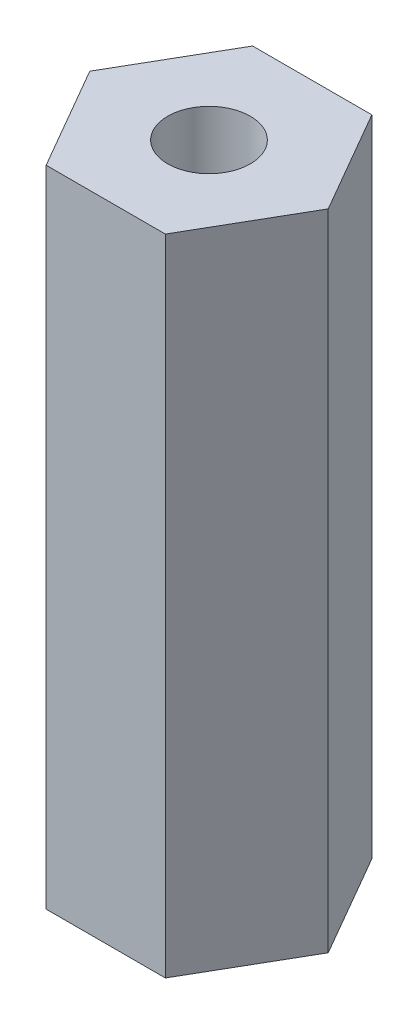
ISO-10303-21;
HEADER;
FILE_DESCRIPTION(('STEP AP214'),'2;1');
FILE_NAME('part.step','',(''),(''),'','','');
FILE_SCHEMA(('AUTOMOTIVE_DESIGN { 1 0 10303 214 1 1 1 1 }'));
ENDSEC;
DATA;
#1=APPLICATION_CONTEXT('core data for automotive mechanical design processes');
#2=APPLICATION_PROTOCOL_DEFINITION('international standard','automotive_design',2000,#1);
#3=PRODUCT_CONTEXT('',#1,'mechanical');
#4=PRODUCT('Part','Part','',(#3));
#5=PRODUCT_RELATED_PRODUCT_CATEGORY('part','',(#4));
#6=PRODUCT_DEFINITION_FORMATION('','',#4);
#7=PRODUCT_DEFINITION_CONTEXT('part definition',#1,'design');
#8=PRODUCT_DEFINITION('design','',#6,#7);
#9=PRODUCT_DEFINITION_SHAPE('','',#8);
#10=(LENGTH_UNIT() NAMED_UNIT(*) SI_UNIT(.MILLI.,.METRE.));
#11=(NAMED_UNIT(*) PLANE_ANGLE_UNIT() SI_UNIT($,.RADIAN.));
#12=(NAMED_UNIT(*) SI_UNIT($,.STERADIAN.) SOLID_ANGLE_UNIT());
#13=UNCERTAINTY_MEASURE_WITH_UNIT(LENGTH_MEASURE(1.E-05),#10,'distance_accuracy_value','');
#14=(GEOMETRIC_REPRESENTATION_CONTEXT(3) GLOBAL_UNCERTAINTY_ASSIGNED_CONTEXT((#13)) GLOBAL_UNIT_ASSIGNED_CONTEXT((#10,
#11,#12)) REPRESENTATION_CONTEXT('',''));
#15=CARTESIAN_POINT('',(0.,0.,0.));
#16=DIRECTION('',(0.,0.,1.));
#17=DIRECTION('',(1.,0.,0.));
#18=AXIS2_PLACEMENT_3D('',#15,#16,#17);
#19=CARTESIAN_POINT('',(0.,19.812,0.));
#20=DIRECTION('',(0.,1.,0.));
#21=DIRECTION('',(0.,0.,1.));
#22=AXIS2_PLACEMENT_3D('',#19,#20,#21);
#23=PLANE('',#22);
#24=DIRECTION('',(0.5,0.,-0.866025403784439));
#25=VECTOR('',#24,1.);
#26=CARTESIAN_POINT('',(1.83308710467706,19.812,3.175));
#27=LINE('',#26,#25);
#28=CARTESIAN_POINT('',(1.83308710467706,19.812,3.175));
#29=VERTEX_POINT('',#28);
#30=CARTESIAN_POINT('',(3.66617420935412,19.812,0.));
#31=VERTEX_POINT('',#30);
#32=EDGE_CURVE('E128',#29,#31,#27,.T.);
#33=ORIENTED_EDGE('',*,*,#32,.T.);
#34=DIRECTION('',(-0.5,0.,-0.866025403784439));
#35=VECTOR('',#34,1.);
#36=CARTESIAN_POINT('',(3.66617420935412,19.812,0.));
#37=LINE('',#36,#35);
#38=CARTESIAN_POINT('',(1.83308710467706,19.812,-3.175));
#39=VERTEX_POINT('',#38);
#40=EDGE_CURVE('E86',#31,#39,#37,.T.);
#41=ORIENTED_EDGE('',*,*,#40,.T.);
#42=DIRECTION('',(-1.,0.,0.));
#43=VECTOR('',#42,1.);
#44=CARTESIAN_POINT('',(1.83308710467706,19.812,-3.175));
#45=LINE('',#44,#43);
#46=CARTESIAN_POINT('',(-1.83308710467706,19.812,-3.175));
#47=VERTEX_POINT('',#46);
#48=EDGE_CURVE('E99',#39,#47,#45,.T.);
#49=ORIENTED_EDGE('',*,*,#48,.T.);
#50=DIRECTION('',(-0.5,0.,0.866025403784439));
#51=VECTOR('',#50,1.);
#52=CARTESIAN_POINT('',(-1.83308710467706,19.812,-3.175));
#53=LINE('',#52,#51);
#54=CARTESIAN_POINT('',(-3.66617420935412,19.812,0.));
#55=VERTEX_POINT('',#54);
#56=EDGE_CURVE('E93',#47,#55,#53,.T.);
#57=ORIENTED_EDGE('',*,*,#56,.T.);
#58=DIRECTION('',(0.5,0.,0.866025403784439));
#59=VECTOR('',#58,1.);
#60=CARTESIAN_POINT('',(-3.66617420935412,19.812,0.));
#61=LINE('',#60,#59);
#62=CARTESIAN_POINT('',(-1.83308710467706,19.812,3.175));
#63=VERTEX_POINT('',#62);
#64=EDGE_CURVE('E97',#55,#63,#61,.T.);
#65=ORIENTED_EDGE('',*,*,#64,.T.);
#66=DIRECTION('',(1.,0.,0.));
#67=VECTOR('',#66,1.);
#68=CARTESIAN_POINT('',(-1.83308710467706,19.812,3.175));
#69=LINE('',#68,#67);
#70=EDGE_CURVE('E49',#63,#29,#69,.T.);
#71=ORIENTED_EDGE('',*,*,#70,.T.);
#72=EDGE_LOOP('',(#33,#41,#49,#57,#65,#71));
#73=FACE_BOUND('',#72,.T.);
#74=CARTESIAN_POINT('',(0.,19.812,0.));
#75=DIRECTION('',(0.,1.,0.));
#76=DIRECTION('',(0.,0.,1.));
#77=AXIS2_PLACEMENT_3D('',#74,#75,#76);
#78=CIRCLE('',#77,1.27);
#79=CARTESIAN_POINT('',(0.,19.812,1.27));
#80=VERTEX_POINT('',#79);
#81=EDGE_CURVE('E121',#80,#80,#78,.T.);
#82=ORIENTED_EDGE('',*,*,#81,.F.);
#83=EDGE_LOOP('',(#82));
#84=FACE_BOUND('',#83,.T.);
#85=ADVANCED_FACE('F32',(#73,#84),#23,.T.);
#86=CARTESIAN_POINT('',(0.,0.,0.));
#87=DIRECTION('',(0.,1.,0.));
#88=DIRECTION('',(0.,0.,1.));
#89=AXIS2_PLACEMENT_3D('',#86,#87,#88);
#90=PLANE('',#89);
#91=DIRECTION('',(0.5,0.,-0.866025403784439));
#92=VECTOR('',#91,1.);
#93=CARTESIAN_POINT('',(1.83308710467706,0.,3.175));
#94=LINE('',#93,#92);
#95=CARTESIAN_POINT('',(1.83308710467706,0.,3.175));
#96=VERTEX_POINT('',#95);
#97=CARTESIAN_POINT('',(3.66617420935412,0.,0.));
#98=VERTEX_POINT('',#97);
#99=EDGE_CURVE('E117',#96,#98,#94,.T.);
#100=ORIENTED_EDGE('',*,*,#99,.F.);
#101=DIRECTION('',(1.,0.,0.));
#102=VECTOR('',#101,1.);
#103=CARTESIAN_POINT('',(-1.83308710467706,0.,3.175));
#104=LINE('',#103,#102);
#105=CARTESIAN_POINT('',(-1.83308710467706,0.,3.175));
#106=VERTEX_POINT('',#105);
#107=EDGE_CURVE('E78',#106,#96,#104,.T.);
#108=ORIENTED_EDGE('',*,*,#107,.F.);
#109=DIRECTION('',(0.5,0.,0.866025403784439));
#110=VECTOR('',#109,1.);
#111=CARTESIAN_POINT('',(-3.66617420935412,0.,0.));
#112=LINE('',#111,#110);
#113=CARTESIAN_POINT('',(-3.66617420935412,0.,0.));
#114=VERTEX_POINT('',#113);
#115=EDGE_CURVE('E72',#114,#106,#112,.T.);
#116=ORIENTED_EDGE('',*,*,#115,.F.);
#117=DIRECTION('',(-0.5,0.,0.866025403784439));
#118=VECTOR('',#117,1.);
#119=CARTESIAN_POINT('',(-1.83308710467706,0.,-3.175));
#120=LINE('',#119,#118);
#121=CARTESIAN_POINT('',(-1.83308710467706,0.,-3.175));
#122=VERTEX_POINT('',#121);
#123=EDGE_CURVE('E107',#122,#114,#120,.T.);
#124=ORIENTED_EDGE('',*,*,#123,.F.);
#125=DIRECTION('',(-1.,0.,0.));
#126=VECTOR('',#125,1.);
#127=CARTESIAN_POINT('',(1.83308710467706,0.,-3.175));
#128=LINE('',#127,#126);
#129=CARTESIAN_POINT('',(1.83308710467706,0.,-3.175));
#130=VERTEX_POINT('',#129);
#131=EDGE_CURVE('E123',#130,#122,#128,.T.);
#132=ORIENTED_EDGE('',*,*,#131,.F.);
#133=DIRECTION('',(-0.5,0.,-0.866025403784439));
#134=VECTOR('',#133,1.);
#135=CARTESIAN_POINT('',(3.66617420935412,0.,0.));
#136=LINE('',#135,#134);
#137=EDGE_CURVE('E120',#98,#130,#136,.T.);
#138=ORIENTED_EDGE('',*,*,#137,.F.);
#139=EDGE_LOOP('',(#100,#108,#116,#124,#132,#138));
#140=FACE_BOUND('',#139,.T.);
#141=CARTESIAN_POINT('',(0.,0.,0.));
#142=DIRECTION('',(0.,1.,0.));
#143=DIRECTION('',(0.,0.,1.));
#144=AXIS2_PLACEMENT_3D('',#141,#142,#143);
#145=CIRCLE('',#144,1.27);
#146=CARTESIAN_POINT('',(0.,0.,1.27));
#147=VERTEX_POINT('',#146);
#148=EDGE_CURVE('E221',#147,#147,#145,.T.);
#149=ORIENTED_EDGE('',*,*,#148,.T.);
#150=EDGE_LOOP('',(#149));
#151=FACE_BOUND('',#150,.T.);
#152=ADVANCED_FACE('F137',(#140,#151),#90,.F.);
#153=CARTESIAN_POINT('',(1.83308710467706,19.812,3.175));
#154=DIRECTION('',(-0.866025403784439,0.,-0.5));
#155=DIRECTION('',(-0.5,0.,0.866025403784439));
#156=AXIS2_PLACEMENT_3D('',#153,#154,#155);
#157=PLANE('',#156);
#158=ORIENTED_EDGE('',*,*,#99,.T.);
#159=DIRECTION('',(0.,-1.,0.));
#160=VECTOR('',#159,1.);
#161=CARTESIAN_POINT('',(3.66617420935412,19.812,0.));
#162=LINE('',#161,#160);
#163=EDGE_CURVE('E11',#31,#98,#162,.T.);
#164=ORIENTED_EDGE('',*,*,#163,.F.);
#165=ORIENTED_EDGE('',*,*,#32,.F.);
#166=DIRECTION('',(0.,-1.,0.));
#167=VECTOR('',#166,1.);
#168=CARTESIAN_POINT('',(1.83308710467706,19.812,3.175));
#169=LINE('',#168,#167);
#170=EDGE_CURVE('E113',#29,#96,#169,.T.);
#171=ORIENTED_EDGE('',*,*,#170,.T.);
#172=EDGE_LOOP('',(#158,#164,#165,#171));
#173=FACE_BOUND('',#172,.T.);
#174=ADVANCED_FACE('F34',(#173),#157,.F.);
#175=CARTESIAN_POINT('',(3.66617420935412,19.812,0.));
#176=DIRECTION('',(-0.866025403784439,0.,0.5));
#177=DIRECTION('',(0.5,0.,0.866025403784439));
#178=AXIS2_PLACEMENT_3D('',#175,#176,#177);
#179=PLANE('',#178);
#180=ORIENTED_EDGE('',*,*,#137,.T.);
#181=DIRECTION('',(0.,-1.,0.));
#182=VECTOR('',#181,1.);
#183=CARTESIAN_POINT('',(1.83308710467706,19.812,-3.175));
#184=LINE('',#183,#182);
#185=EDGE_CURVE('E41',#39,#130,#184,.T.);
#186=ORIENTED_EDGE('',*,*,#185,.F.);
#187=ORIENTED_EDGE('',*,*,#40,.F.);
#188=ORIENTED_EDGE('',*,*,#163,.T.);
#189=EDGE_LOOP('',(#180,#186,#187,#188));
#190=FACE_BOUND('',#189,.T.);
#191=ADVANCED_FACE('F162',(#190),#179,.F.);
#192=CARTESIAN_POINT('',(1.83308710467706,19.812,-3.175));
#193=DIRECTION('',(0.,0.,1.));
#194=DIRECTION('',(1.,0.,0.));
#195=AXIS2_PLACEMENT_3D('',#192,#193,#194);
#196=PLANE('',#195);
#197=ORIENTED_EDGE('',*,*,#131,.T.);
#198=DIRECTION('',(0.,-1.,0.));
#199=VECTOR('',#198,1.);
#200=CARTESIAN_POINT('',(-1.83308710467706,19.812,-3.175));
#201=LINE('',#200,#199);
#202=EDGE_CURVE('E108',#47,#122,#201,.T.);
#203=ORIENTED_EDGE('',*,*,#202,.F.);
#204=ORIENTED_EDGE('',*,*,#48,.F.);
#205=ORIENTED_EDGE('',*,*,#185,.T.);
#206=EDGE_LOOP('',(#197,#203,#204,#205));
#207=FACE_BOUND('',#206,.T.);
#208=ADVANCED_FACE('F134',(#207),#196,.F.);
#209=CARTESIAN_POINT('',(-1.83308710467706,19.812,-3.175));
#210=DIRECTION('',(0.866025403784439,0.,0.5));
#211=DIRECTION('',(0.5,0.,-0.866025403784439));
#212=AXIS2_PLACEMENT_3D('',#209,#210,#211);
#213=PLANE('',#212);
#214=ORIENTED_EDGE('',*,*,#123,.T.);
#215=DIRECTION('',(0.,-1.,0.));
#216=VECTOR('',#215,1.);
#217=CARTESIAN_POINT('',(-3.66617420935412,19.812,0.));
#218=LINE('',#217,#216);
#219=EDGE_CURVE('E104',#55,#114,#218,.T.);
#220=ORIENTED_EDGE('',*,*,#219,.F.);
#221=ORIENTED_EDGE('',*,*,#56,.F.);
#222=ORIENTED_EDGE('',*,*,#202,.T.);
#223=EDGE_LOOP('',(#214,#220,#221,#222));
#224=FACE_BOUND('',#223,.T.);
#225=ADVANCED_FACE('F105',(#224),#213,.F.);
#226=CARTESIAN_POINT('',(-3.66617420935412,19.812,0.));
#227=DIRECTION('',(0.866025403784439,0.,-0.5));
#228=DIRECTION('',(-0.5,0.,-0.866025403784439));
#229=AXIS2_PLACEMENT_3D('',#226,#227,#228);
#230=PLANE('',#229);
#231=ORIENTED_EDGE('',*,*,#115,.T.);
#232=DIRECTION('',(0.,-1.,0.));
#233=VECTOR('',#232,1.);
#234=CARTESIAN_POINT('',(-1.83308710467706,19.812,3.175));
#235=LINE('',#234,#233);
#236=EDGE_CURVE('E109',#63,#106,#235,.T.);
#237=ORIENTED_EDGE('',*,*,#236,.F.);
#238=ORIENTED_EDGE('',*,*,#64,.F.);
#239=ORIENTED_EDGE('',*,*,#219,.T.);
#240=EDGE_LOOP('',(#231,#237,#238,#239));
#241=FACE_BOUND('',#240,.T.);
#242=ADVANCED_FACE('F111',(#241),#230,.F.);
#243=CARTESIAN_POINT('',(-1.83308710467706,19.812,3.175));
#244=DIRECTION('',(0.,0.,-1.));
#245=DIRECTION('',(-1.,0.,0.));
#246=AXIS2_PLACEMENT_3D('',#243,#244,#245);
#247=PLANE('',#246);
#248=ORIENTED_EDGE('',*,*,#107,.T.);
#249=ORIENTED_EDGE('',*,*,#170,.F.);
#250=ORIENTED_EDGE('',*,*,#70,.F.);
#251=ORIENTED_EDGE('',*,*,#236,.T.);
#252=EDGE_LOOP('',(#248,#249,#250,#251));
#253=FACE_BOUND('',#252,.T.);
#254=ADVANCED_FACE('F142',(#253),#247,.F.);
#255=CARTESIAN_POINT('',(0.,19.812,0.));
#256=DIRECTION('',(0.,-1.,0.));
#257=DIRECTION('',(0.,0.,-1.));
#258=AXIS2_PLACEMENT_3D('',#255,#256,#257);
#259=CYLINDRICAL_SURFACE('',#258,1.27);
#260=ORIENTED_EDGE('',*,*,#81,.T.);
#261=EDGE_LOOP('',(#260));
#262=FACE_BOUND('',#261,.T.);
#263=ORIENTED_EDGE('',*,*,#148,.F.);
#264=EDGE_LOOP('',(#263));
#265=FACE_BOUND('',#264,.T.);
#266=ADVANCED_FACE('F144',(#262,#265),#259,.F.);
#267=CLOSED_SHELL('',(#85,#152,#174,#191,#208,#225,#242,#254,#266));
#268=MANIFOLD_SOLID_BREP('B2',#267);
#269=ADVANCED_BREP_SHAPE_REPRESENTATION('',(#18,#268),#14);
#270=SHAPE_DEFINITION_REPRESENTATION(#9,#269);
ENDSEC;
END-ISO-10303-21;
